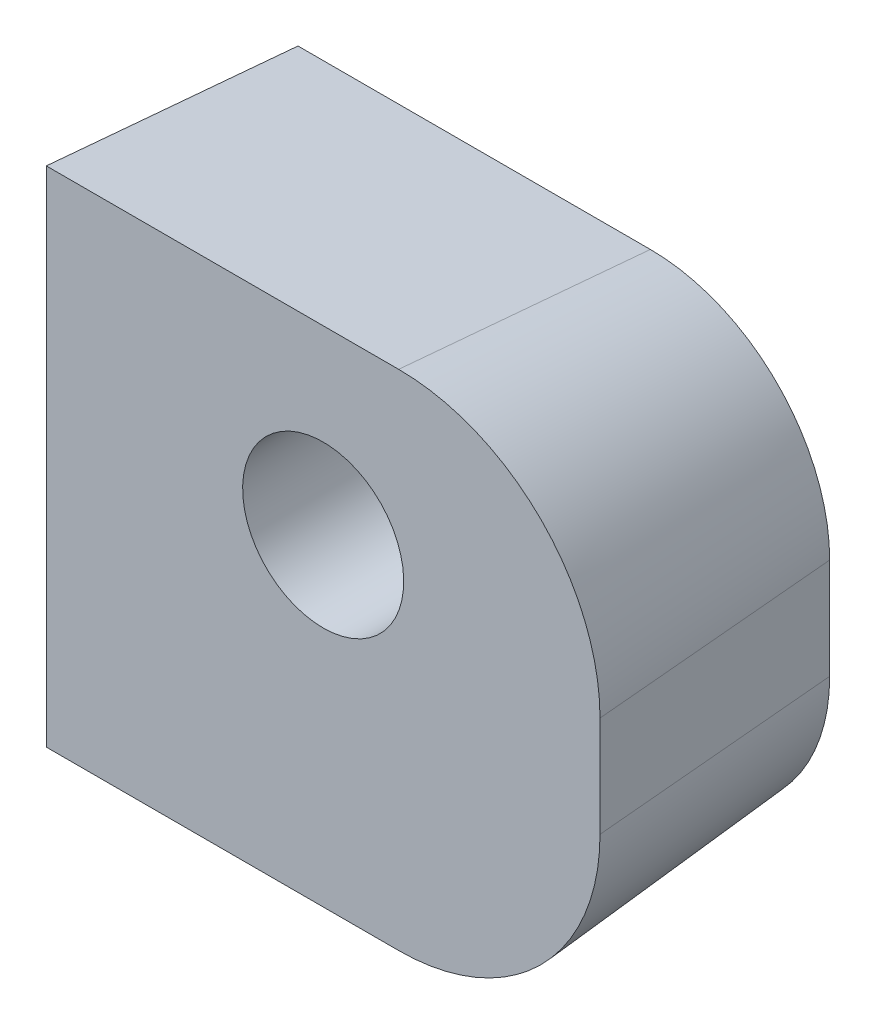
ISO-10303-21;
HEADER;
FILE_DESCRIPTION(('STEP AP214'),'2;1');
FILE_NAME('part.step','',(''),(''),'','','');
FILE_SCHEMA(('AUTOMOTIVE_DESIGN { 1 0 10303 214 1 1 1 1 }'));
ENDSEC;
DATA;
#1=APPLICATION_CONTEXT('core data for automotive mechanical design processes');
#2=APPLICATION_PROTOCOL_DEFINITION('international standard','automotive_design',2000,#1);
#3=PRODUCT_CONTEXT('',#1,'mechanical');
#4=PRODUCT('Part','Part','',(#3));
#5=PRODUCT_RELATED_PRODUCT_CATEGORY('part','',(#4));
#6=PRODUCT_DEFINITION_FORMATION('','',#4);
#7=PRODUCT_DEFINITION_CONTEXT('part definition',#1,'design');
#8=PRODUCT_DEFINITION('design','',#6,#7);
#9=PRODUCT_DEFINITION_SHAPE('','',#8);
#10=(LENGTH_UNIT() NAMED_UNIT(*) SI_UNIT(.MILLI.,.METRE.));
#11=(NAMED_UNIT(*) PLANE_ANGLE_UNIT() SI_UNIT($,.RADIAN.));
#12=(NAMED_UNIT(*) SI_UNIT($,.STERADIAN.) SOLID_ANGLE_UNIT());
#13=UNCERTAINTY_MEASURE_WITH_UNIT(LENGTH_MEASURE(1.E-05),#10,'distance_accuracy_value','');
#14=(GEOMETRIC_REPRESENTATION_CONTEXT(3) GLOBAL_UNCERTAINTY_ASSIGNED_CONTEXT((#13)) GLOBAL_UNIT_ASSIGNED_CONTEXT((#10,
#11,#12)) REPRESENTATION_CONTEXT('',''));
#15=CARTESIAN_POINT('',(0.,0.,0.));
#16=DIRECTION('',(0.,0.,1.));
#17=DIRECTION('',(1.,0.,0.));
#18=AXIS2_PLACEMENT_3D('',#15,#16,#17);
#19=CARTESIAN_POINT('',(71.008677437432,9.04516403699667,-2.51250000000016));
#20=DIRECTION('',(0.,0.,-1.));
#21=DIRECTION('',(-1.,0.,0.));
#22=AXIS2_PLACEMENT_3D('',#19,#20,#21);
#23=PLANE('',#22);
#24=DIRECTION('',(-1.,0.,0.));
#25=VECTOR('',#24,1.);
#26=CARTESIAN_POINT('',(71.008677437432,8.82534876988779,-2.51250000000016));
#27=LINE('',#26,#25);
#28=CARTESIAN_POINT('',(71.008677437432,8.82534876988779,-2.51250000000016));
#29=VERTEX_POINT('',#28);
#30=CARTESIAN_POINT('',(74.526177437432,8.82534876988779,-2.51250000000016));
#31=VERTEX_POINT('',#30);
#32=EDGE_CURVE('E154',#29,#31,#27,.F.);
#33=ORIENTED_EDGE('',*,*,#32,.T.);
#34=CARTESIAN_POINT('',(74.526177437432,7.03516403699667,-2.51250000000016));
#35=DIRECTION('',(0.,0.,-1.));
#36=DIRECTION('',(0.,-1.,0.));
#37=AXIS2_PLACEMENT_3D('',#34,#35,#36);
#38=CIRCLE('',#37,1.79018473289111);
#39=CARTESIAN_POINT('',(76.3163621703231,7.03516403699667,-2.51250000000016));
#40=VERTEX_POINT('',#39);
#41=EDGE_CURVE('E157',#31,#40,#38,.T.);
#42=ORIENTED_EDGE('',*,*,#41,.T.);
#43=DIRECTION('',(0.,1.,0.));
#44=VECTOR('',#43,1.);
#45=CARTESIAN_POINT('',(76.3163621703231,9.04516403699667,-2.51250000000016));
#46=LINE('',#45,#44);
#47=CARTESIAN_POINT('',(76.3163621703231,6.03016403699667,-2.51250000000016));
#48=VERTEX_POINT('',#47);
#49=EDGE_CURVE('E87',#40,#48,#46,.F.);
#50=ORIENTED_EDGE('',*,*,#49,.T.);
#51=CARTESIAN_POINT('',(74.526177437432,6.03016403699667,-2.51250000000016));
#52=DIRECTION('',(0.,0.,-1.));
#53=DIRECTION('',(0.,-1.,0.));
#54=AXIS2_PLACEMENT_3D('',#51,#52,#53);
#55=CIRCLE('',#54,1.79018473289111);
#56=CARTESIAN_POINT('',(74.526177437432,4.23997930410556,-2.51250000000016));
#57=VERTEX_POINT('',#56);
#58=EDGE_CURVE('E84',#48,#57,#55,.T.);
#59=ORIENTED_EDGE('',*,*,#58,.T.);
#60=DIRECTION('',(1.,0.,0.));
#61=VECTOR('',#60,1.);
#62=CARTESIAN_POINT('',(71.008677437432,4.23997930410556,-2.51250000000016));
#63=LINE('',#62,#61);
#64=CARTESIAN_POINT('',(71.008677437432,4.23997930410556,-2.51250000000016));
#65=VERTEX_POINT('',#64);
#66=EDGE_CURVE('E82',#57,#65,#63,.F.);
#67=ORIENTED_EDGE('',*,*,#66,.T.);
#68=DIRECTION('',(0.,1.,0.));
#69=VECTOR('',#68,1.);
#70=CARTESIAN_POINT('',(71.008677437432,4.02016403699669,-2.51250000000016));
#71=LINE('',#70,#69);
#72=EDGE_CURVE('E95',#65,#29,#71,.T.);
#73=ORIENTED_EDGE('',*,*,#72,.T.);
#74=EDGE_LOOP('',(#33,#42,#50,#59,#67,#73));
#75=FACE_BOUND('',#74,.T.);
#76=CARTESIAN_POINT('',(73.772427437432,7.23616403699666,-2.51250000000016));
#77=DIRECTION('',(0.,0.,-1.));
#78=DIRECTION('',(0.,-1.,0.));
#79=AXIS2_PLACEMENT_3D('',#76,#77,#78);
#80=CIRCLE('',#79,0.804);
#81=CARTESIAN_POINT('',(73.772427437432,6.43216403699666,-2.51250000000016));
#82=VERTEX_POINT('',#81);
#83=EDGE_CURVE('E20',#82,#82,#80,.F.);
#84=ORIENTED_EDGE('',*,*,#83,.T.);
#85=EDGE_LOOP('',(#84));
#86=FACE_BOUND('',#85,.T.);
#87=ADVANCED_FACE('F16',(#75,#86),#23,.T.);
#88=CARTESIAN_POINT('',(71.008677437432,9.04516403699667,-1.63879326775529E-13));
#89=DIRECTION('',(0.,0.,-1.));
#90=DIRECTION('',(-1.,0.,0.));
#91=AXIS2_PLACEMENT_3D('',#88,#89,#90);
#92=PLANE('',#91);
#93=DIRECTION('',(0.,1.,0.));
#94=VECTOR('',#93,1.);
#95=CARTESIAN_POINT('',(76.536177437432,9.04516403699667,-1.63879326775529E-13));
#96=LINE('',#95,#94);
#97=CARTESIAN_POINT('',(76.536177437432,7.03516403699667,-1.63879326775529E-13));
#98=VERTEX_POINT('',#97);
#99=CARTESIAN_POINT('',(76.536177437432,6.03016403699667,-1.63879326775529E-13));
#100=VERTEX_POINT('',#99);
#101=EDGE_CURVE('E110',#98,#100,#96,.F.);
#102=ORIENTED_EDGE('',*,*,#101,.F.);
#103=CARTESIAN_POINT('',(74.526177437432,7.03516403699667,-1.63879326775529E-13));
#104=DIRECTION('',(0.,0.,-1.));
#105=DIRECTION('',(0.,-1.,0.));
#106=AXIS2_PLACEMENT_3D('',#103,#104,#105);
#107=CIRCLE('',#106,2.01);
#108=CARTESIAN_POINT('',(74.526177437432,9.04516403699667,-1.63879326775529E-13));
#109=VERTEX_POINT('',#108);
#110=EDGE_CURVE('E75',#98,#109,#107,.F.);
#111=ORIENTED_EDGE('',*,*,#110,.T.);
#112=DIRECTION('',(-1.,0.,0.));
#113=VECTOR('',#112,1.);
#114=CARTESIAN_POINT('',(71.008677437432,9.04516403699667,-1.63879326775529E-13));
#115=LINE('',#114,#113);
#116=CARTESIAN_POINT('',(71.008677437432,9.04516403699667,-1.63879326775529E-13));
#117=VERTEX_POINT('',#116);
#118=EDGE_CURVE('E135',#117,#109,#115,.F.);
#119=ORIENTED_EDGE('',*,*,#118,.F.);
#120=DIRECTION('',(0.,1.,0.));
#121=VECTOR('',#120,1.);
#122=CARTESIAN_POINT('',(71.008677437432,4.02016403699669,-1.63879326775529E-13));
#123=LINE('',#122,#121);
#124=CARTESIAN_POINT('',(71.008677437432,4.02016403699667,-1.63879326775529E-13));
#125=VERTEX_POINT('',#124);
#126=EDGE_CURVE('E119',#125,#117,#123,.T.);
#127=ORIENTED_EDGE('',*,*,#126,.F.);
#128=DIRECTION('',(1.,0.,0.));
#129=VECTOR('',#128,1.);
#130=CARTESIAN_POINT('',(71.008677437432,4.02016403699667,-1.63879326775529E-13));
#131=LINE('',#130,#129);
#132=CARTESIAN_POINT('',(74.526177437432,4.02016403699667,-1.63879326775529E-13));
#133=VERTEX_POINT('',#132);
#134=EDGE_CURVE('E27',#133,#125,#131,.F.);
#135=ORIENTED_EDGE('',*,*,#134,.F.);
#136=CARTESIAN_POINT('',(74.526177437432,6.03016403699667,-1.63879326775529E-13));
#137=DIRECTION('',(0.,0.,-1.));
#138=DIRECTION('',(0.,-1.,0.));
#139=AXIS2_PLACEMENT_3D('',#136,#137,#138);
#140=CIRCLE('',#139,2.01);
#141=EDGE_CURVE('E36',#133,#100,#140,.F.);
#142=ORIENTED_EDGE('',*,*,#141,.T.);
#143=EDGE_LOOP('',(#102,#111,#119,#127,#135,#142));
#144=FACE_BOUND('',#143,.T.);
#145=CARTESIAN_POINT('',(73.772427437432,7.23616403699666,-1.60392532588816E-13));
#146=DIRECTION('',(0.,0.,-1.));
#147=DIRECTION('',(0.,-1.,0.));
#148=AXIS2_PLACEMENT_3D('',#145,#146,#147);
#149=CIRCLE('',#148,0.804);
#150=CARTESIAN_POINT('',(73.772427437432,6.43216403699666,-1.60392532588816E-13));
#151=VERTEX_POINT('',#150);
#152=EDGE_CURVE('E11',#151,#151,#149,.F.);
#153=ORIENTED_EDGE('',*,*,#152,.F.);
#154=EDGE_LOOP('',(#153));
#155=FACE_BOUND('',#154,.T.);
#156=ADVANCED_FACE('F303',(#144,#155),#92,.F.);
#157=CARTESIAN_POINT('',(71.008677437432,4.02016403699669,-2.51250000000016));
#158=DIRECTION('',(1.,0.,0.));
#159=DIRECTION('',(0.,-1.,0.));
#160=AXIS2_PLACEMENT_3D('',#157,#158,#159);
#161=PLANE('',#160);
#162=ORIENTED_EDGE('',*,*,#126,.T.);
#163=DIRECTION('',(0.,-0.0871557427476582,-0.996194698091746));
#164=VECTOR('',#163,1.);
#165=CARTESIAN_POINT('',(71.008677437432,9.04516403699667,-1.63879326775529E-13));
#166=LINE('',#165,#164);
#167=EDGE_CURVE('E151',#29,#117,#166,.F.);
#168=ORIENTED_EDGE('',*,*,#167,.F.);
#169=ORIENTED_EDGE('',*,*,#72,.F.);
#170=DIRECTION('',(0.,0.0871557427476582,-0.996194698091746));
#171=VECTOR('',#170,1.);
#172=CARTESIAN_POINT('',(71.008677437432,4.23830956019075,-2.49341473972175));
#173=LINE('',#172,#171);
#174=EDGE_CURVE('E92',#65,#125,#173,.F.);
#175=ORIENTED_EDGE('',*,*,#174,.T.);
#176=EDGE_LOOP('',(#162,#168,#169,#175));
#177=FACE_BOUND('',#176,.T.);
#178=ADVANCED_FACE('F296',(#177),#161,.F.);
#179=CARTESIAN_POINT('',(71.008677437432,9.04516403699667,-1.63879326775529E-13));
#180=DIRECTION('',(0.,0.996194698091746,-0.0871557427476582));
#181=DIRECTION('',(0.,-0.0871557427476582,-0.996194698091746));
#182=AXIS2_PLACEMENT_3D('',#179,#180,#181);
#183=PLANE('',#182);
#184=ORIENTED_EDGE('',*,*,#118,.T.);
#185=DIRECTION('',(0.,0.0871557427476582,0.996194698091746));
#186=VECTOR('',#185,1.);
#187=CARTESIAN_POINT('',(74.526177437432,9.04516403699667,-1.63879326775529E-13));
#188=LINE('',#187,#186);
#189=EDGE_CURVE('E146',#109,#31,#188,.F.);
#190=ORIENTED_EDGE('',*,*,#189,.T.);
#191=ORIENTED_EDGE('',*,*,#32,.F.);
#192=ORIENTED_EDGE('',*,*,#167,.T.);
#193=EDGE_LOOP('',(#184,#190,#191,#192));
#194=FACE_BOUND('',#193,.T.);
#195=ADVANCED_FACE('F171',(#194),#183,.T.);
#196=CARTESIAN_POINT('',(76.536177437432,9.04516403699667,-1.63879326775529E-13));
#197=DIRECTION('',(0.996194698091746,0.,-0.0871557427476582));
#198=DIRECTION('',(-0.0871557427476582,0.,-0.996194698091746));
#199=AXIS2_PLACEMENT_3D('',#196,#197,#198);
#200=PLANE('',#199);
#201=ORIENTED_EDGE('',*,*,#49,.F.);
#202=DIRECTION('',(0.0871557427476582,0.,0.996194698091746));
#203=VECTOR('',#202,1.);
#204=CARTESIAN_POINT('',(76.536177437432,7.03516403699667,-1.63848689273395E-13));
#205=LINE('',#204,#203);
#206=EDGE_CURVE('E114',#40,#98,#205,.T.);
#207=ORIENTED_EDGE('',*,*,#206,.T.);
#208=ORIENTED_EDGE('',*,*,#101,.T.);
#209=DIRECTION('',(0.0871557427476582,0.,0.996194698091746));
#210=VECTOR('',#209,1.);
#211=CARTESIAN_POINT('',(76.536177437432,6.03016403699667,-1.63833370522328E-13));
#212=LINE('',#211,#210);
#213=EDGE_CURVE('E55',#100,#48,#212,.F.);
#214=ORIENTED_EDGE('',*,*,#213,.T.);
#215=EDGE_LOOP('',(#201,#207,#208,#214));
#216=FACE_BOUND('',#215,.T.);
#217=ADVANCED_FACE('F283',(#216),#200,.T.);
#218=CARTESIAN_POINT('',(71.008677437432,4.02016403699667,-1.63879326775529E-13));
#219=DIRECTION('',(0.,-0.996194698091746,-0.0871557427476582));
#220=DIRECTION('',(0.,-0.0871557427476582,0.996194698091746));
#221=AXIS2_PLACEMENT_3D('',#218,#219,#220);
#222=PLANE('',#221);
#223=ORIENTED_EDGE('',*,*,#66,.F.);
#224=DIRECTION('',(0.,-0.0871557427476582,0.996194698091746));
#225=VECTOR('',#224,1.);
#226=CARTESIAN_POINT('',(74.526177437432,4.02016403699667,-1.63879326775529E-13));
#227=LINE('',#226,#225);
#228=EDGE_CURVE('E91',#57,#133,#227,.T.);
#229=ORIENTED_EDGE('',*,*,#228,.T.);
#230=ORIENTED_EDGE('',*,*,#134,.T.);
#231=ORIENTED_EDGE('',*,*,#174,.F.);
#232=EDGE_LOOP('',(#223,#229,#230,#231));
#233=FACE_BOUND('',#232,.T.);
#234=ADVANCED_FACE('F90',(#233),#222,.T.);
#235=CARTESIAN_POINT('',(74.526177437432,7.03516403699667,-1.63879326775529E-13));
#236=DIRECTION('',(0.,0.,1.));
#237=DIRECTION('',(0.,-1.,0.));
#238=AXIS2_PLACEMENT_3D('',#235,#236,#237);
#239=CONICAL_SURFACE('',#238,2.01,0.0872664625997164);
#240=ORIENTED_EDGE('',*,*,#41,.F.);
#241=ORIENTED_EDGE('',*,*,#189,.F.);
#242=ORIENTED_EDGE('',*,*,#110,.F.);
#243=ORIENTED_EDGE('',*,*,#206,.F.);
#244=EDGE_LOOP('',(#240,#241,#242,#243));
#245=FACE_BOUND('',#244,.T.);
#246=ADVANCED_FACE('F175',(#245),#239,.T.);
#247=CARTESIAN_POINT('',(74.526177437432,6.03016403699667,-1.63879326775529E-13));
#248=DIRECTION('',(0.,0.,1.));
#249=DIRECTION('',(0.,-1.,0.));
#250=AXIS2_PLACEMENT_3D('',#247,#248,#249);
#251=CONICAL_SURFACE('',#250,2.01,0.0872664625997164);
#252=ORIENTED_EDGE('',*,*,#58,.F.);
#253=ORIENTED_EDGE('',*,*,#213,.F.);
#254=ORIENTED_EDGE('',*,*,#141,.F.);
#255=ORIENTED_EDGE('',*,*,#228,.F.);
#256=EDGE_LOOP('',(#252,#253,#254,#255));
#257=FACE_BOUND('',#256,.T.);
#258=ADVANCED_FACE('F97',(#257),#251,.T.);
#259=CARTESIAN_POINT('',(73.772427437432,7.23616403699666,43.9220645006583));
#260=DIRECTION('',(0.,0.,-1.));
#261=DIRECTION('',(-1.,0.,0.));
#262=AXIS2_PLACEMENT_3D('',#259,#260,#261);
#263=CYLINDRICAL_SURFACE('',#262,0.804);
#264=ORIENTED_EDGE('',*,*,#83,.F.);
#265=EDGE_LOOP('',(#264));
#266=FACE_BOUND('',#265,.T.);
#267=ORIENTED_EDGE('',*,*,#152,.T.);
#268=EDGE_LOOP('',(#267));
#269=FACE_BOUND('',#268,.T.);
#270=ADVANCED_FACE('F18',(#266,#269),#263,.F.);
#271=CLOSED_SHELL('',(#87,#156,#178,#195,#217,#234,#246,#258,#270));
#272=MANIFOLD_SOLID_BREP('B1',#271);
#273=ADVANCED_BREP_SHAPE_REPRESENTATION('',(#18,#272),#14);
#274=SHAPE_DEFINITION_REPRESENTATION(#9,#273);
ENDSEC;
END-ISO-10303-21;
